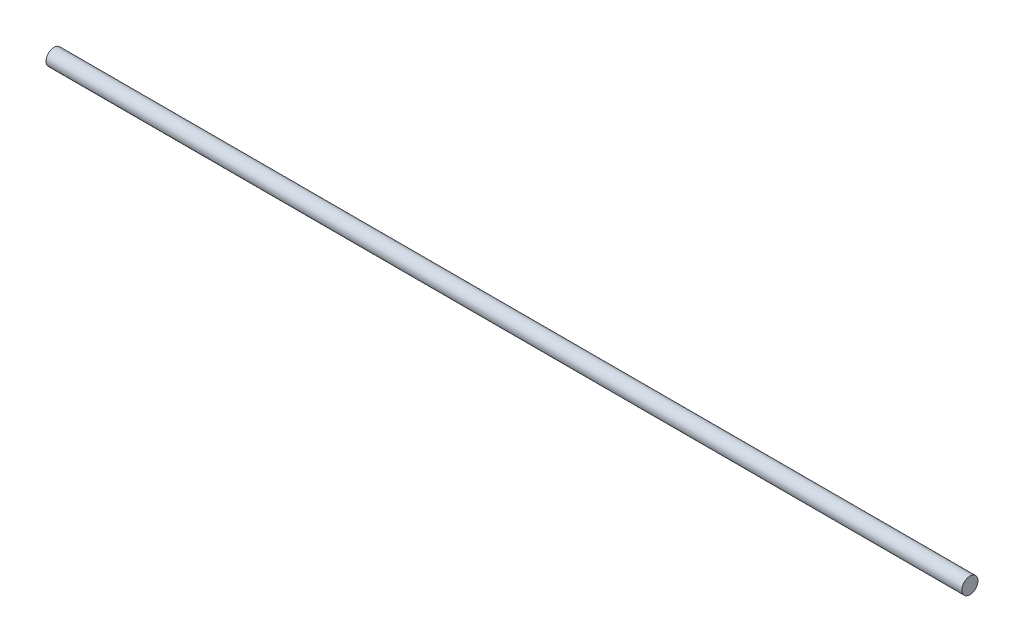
ISO-10303-21;
HEADER;
FILE_DESCRIPTION(('STEP AP214'),'2;1');
FILE_NAME('part.step','',(''),(''),'','','');
FILE_SCHEMA(('AUTOMOTIVE_DESIGN { 1 0 10303 214 1 1 1 1 }'));
ENDSEC;
DATA;
#1=APPLICATION_CONTEXT('core data for automotive mechanical design processes');
#2=APPLICATION_PROTOCOL_DEFINITION('international standard','automotive_design',2000,#1);
#3=PRODUCT_CONTEXT('',#1,'mechanical');
#4=PRODUCT('Part','Part','',(#3));
#5=PRODUCT_RELATED_PRODUCT_CATEGORY('part','',(#4));
#6=PRODUCT_DEFINITION_FORMATION('','',#4);
#7=PRODUCT_DEFINITION_CONTEXT('part definition',#1,'design');
#8=PRODUCT_DEFINITION('design','',#6,#7);
#9=PRODUCT_DEFINITION_SHAPE('','',#8);
#10=(LENGTH_UNIT() NAMED_UNIT(*) SI_UNIT(.MILLI.,.METRE.));
#11=(NAMED_UNIT(*) PLANE_ANGLE_UNIT() SI_UNIT($,.RADIAN.));
#12=(NAMED_UNIT(*) SI_UNIT($,.STERADIAN.) SOLID_ANGLE_UNIT());
#13=UNCERTAINTY_MEASURE_WITH_UNIT(LENGTH_MEASURE(1.E-05),#10,'distance_accuracy_value','');
#14=(GEOMETRIC_REPRESENTATION_CONTEXT(3) GLOBAL_UNCERTAINTY_ASSIGNED_CONTEXT((#13)) GLOBAL_UNIT_ASSIGNED_CONTEXT((#10,
#11,#12)) REPRESENTATION_CONTEXT('',''));
#15=CARTESIAN_POINT('',(0.,0.,0.));
#16=DIRECTION('',(0.,0.,1.));
#17=DIRECTION('',(1.,0.,0.));
#18=AXIS2_PLACEMENT_3D('',#15,#16,#17);
#19=CARTESIAN_POINT('',(431.8,0.,0.));
#20=DIRECTION('',(-1.,0.,0.));
#21=DIRECTION('',(0.,0.,1.));
#22=AXIS2_PLACEMENT_3D('',#19,#20,#21);
#23=CYLINDRICAL_SURFACE('',#22,7.6);
#24=CARTESIAN_POINT('',(431.8,0.,0.));
#25=DIRECTION('',(1.,0.,0.));
#26=DIRECTION('',(0.,0.,-1.));
#27=AXIS2_PLACEMENT_3D('',#24,#25,#26);
#28=CIRCLE('',#27,7.6);
#29=CARTESIAN_POINT('',(431.8,0.,-7.6));
#30=VERTEX_POINT('',#29);
#31=EDGE_CURVE('E10',#30,#30,#28,.T.);
#32=ORIENTED_EDGE('',*,*,#31,.F.);
#33=EDGE_LOOP('',(#32));
#34=FACE_BOUND('',#33,.T.);
#35=CARTESIAN_POINT('',(-431.8,0.,0.));
#36=DIRECTION('',(1.,0.,0.));
#37=DIRECTION('',(0.,0.,-1.));
#38=AXIS2_PLACEMENT_3D('',#35,#36,#37);
#39=CIRCLE('',#38,7.6);
#40=CARTESIAN_POINT('',(-431.8,0.,-7.6));
#41=VERTEX_POINT('',#40);
#42=EDGE_CURVE('E34',#41,#41,#39,.T.);
#43=ORIENTED_EDGE('',*,*,#42,.T.);
#44=EDGE_LOOP('',(#43));
#45=FACE_BOUND('',#44,.T.);
#46=ADVANCED_FACE('F28',(#34,#45),#23,.T.);
#47=CARTESIAN_POINT('',(431.8,0.,0.));
#48=DIRECTION('',(1.,0.,0.));
#49=DIRECTION('',(0.,0.,-1.));
#50=AXIS2_PLACEMENT_3D('',#47,#48,#49);
#51=PLANE('',#50);
#52=ORIENTED_EDGE('',*,*,#31,.T.);
#53=EDGE_LOOP('',(#52));
#54=FACE_BOUND('',#53,.T.);
#55=ADVANCED_FACE('F43',(#54),#51,.T.);
#56=CARTESIAN_POINT('',(-431.8,0.,0.));
#57=DIRECTION('',(1.,0.,0.));
#58=DIRECTION('',(0.,0.,-1.));
#59=AXIS2_PLACEMENT_3D('',#56,#57,#58);
#60=PLANE('',#59);
#61=ORIENTED_EDGE('',*,*,#42,.F.);
#62=EDGE_LOOP('',(#61));
#63=FACE_BOUND('',#62,.T.);
#64=ADVANCED_FACE('F41',(#63),#60,.F.);
#65=CLOSED_SHELL('',(#46,#55,#64));
#66=MANIFOLD_SOLID_BREP('B2',#65);
#67=ADVANCED_BREP_SHAPE_REPRESENTATION('',(#18,#66),#14);
#68=SHAPE_DEFINITION_REPRESENTATION(#9,#67);
ENDSEC;
END-ISO-10303-21;
